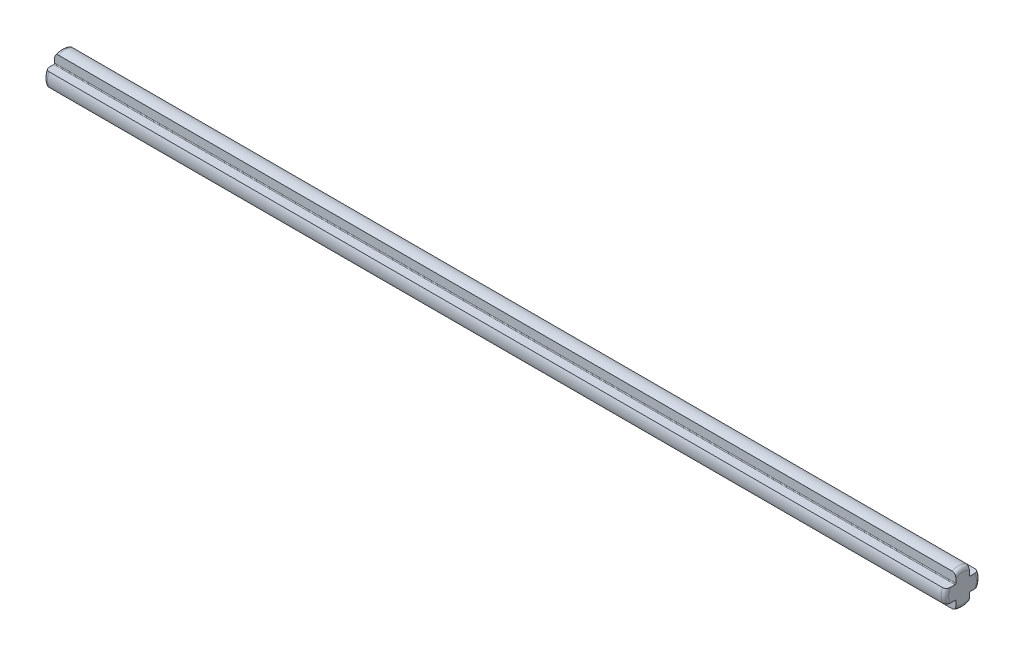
from build123d import *

# Parameters (mm, degrees)
EXTRUIR1_DEPTH = 60
REDONDEO1_R    = 0.5


with BuildPart() as part:
    # Croquis1 → Extruir1 (new, symmetric)
    with BuildSketch(Plane(origin=(0, 0, 0), x_dir=(0, 0, -1), z_dir=(1, 0, 0))):
        with BuildLine():
            Line((-0.9, 2.170829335), (-0.9, 1))
            ThreePointArc((-0.9, 1), (-0.929289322, 0.929289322), (-1, 0.9))
            Line((-1, 0.9), (-2.170829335, 0.9))
            ThreePointArc((-2.170829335, 0.9), (-2.35, 0), (-2.170829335, -0.9))
            Line((-2.170829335, -0.9), (-1, -0.9))
            ThreePointArc((-1, -0.9), (-0.929289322, -0.929289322), (-0.9, -1))
            Line((-0.9, -1), (-0.9, -2.170829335))
            ThreePointArc((-0.9, -2.170829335), (0, -2.35), (0.9, -2.170829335))
            Line((0.9, -2.170829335), (0.9, -1))
            ThreePointArc((0.9, -1), (0.929289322, -0.929289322), (1, -0.9))
            Line((1, -0.9), (2.170829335, -0.9))
            ThreePointArc((2.170829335, -0.9), (2.35, 0), (2.170829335, 0.9))
            Line((2.170829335, 0.9), (1, 0.9))
            ThreePointArc((1, 0.9), (0.929289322, 0.929289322), (0.9, 1))
            Line((0.9, 1), (0.9, 2.170829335))
            ThreePointArc((0.9, 2.170829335), (0, 2.35), (-0.9, 2.170829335))
        make_face()
    extrude(amount=EXTRUIR1_DEPTH, both=True)

    # Redondeo1
    redondeo1_edges = [part.edges().sort_by_distance(p)[0] for p in [
        (-60, 2.35, 0),
        (60, -2.35, 0),
        (-60, 0, -2.35),
        (-60, -2.35, 0),
        (-60, 0, 2.35),
        (60, 0, -2.35),
        (60, 0, 2.35),
        (60, 2.35, 0),
    ]]
    fillet(redondeo1_edges, radius=REDONDEO1_R)


solid = part.part
